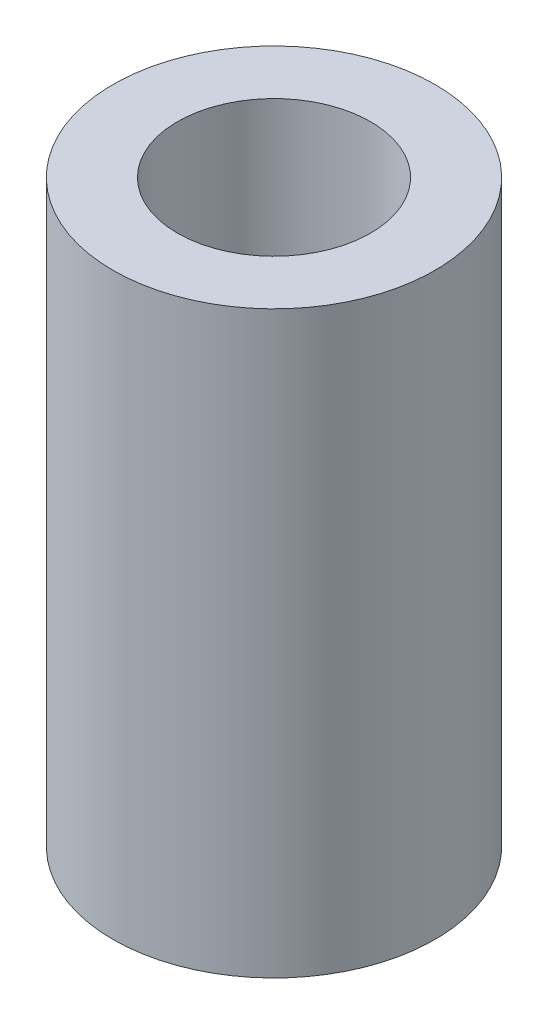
ISO-10303-21;
HEADER;
FILE_DESCRIPTION(('STEP AP214'),'2;1');
FILE_NAME('part.step','',(''),(''),'','','');
FILE_SCHEMA(('AUTOMOTIVE_DESIGN { 1 0 10303 214 1 1 1 1 }'));
ENDSEC;
DATA;
#1=APPLICATION_CONTEXT('core data for automotive mechanical design processes');
#2=APPLICATION_PROTOCOL_DEFINITION('international standard','automotive_design',2000,#1);
#3=PRODUCT_CONTEXT('',#1,'mechanical');
#4=PRODUCT('Part','Part','',(#3));
#5=PRODUCT_RELATED_PRODUCT_CATEGORY('part','',(#4));
#6=PRODUCT_DEFINITION_FORMATION('','',#4);
#7=PRODUCT_DEFINITION_CONTEXT('part definition',#1,'design');
#8=PRODUCT_DEFINITION('design','',#6,#7);
#9=PRODUCT_DEFINITION_SHAPE('','',#8);
#10=(LENGTH_UNIT() NAMED_UNIT(*) SI_UNIT(.MILLI.,.METRE.));
#11=(NAMED_UNIT(*) PLANE_ANGLE_UNIT() SI_UNIT($,.RADIAN.));
#12=(NAMED_UNIT(*) SI_UNIT($,.STERADIAN.) SOLID_ANGLE_UNIT());
#13=UNCERTAINTY_MEASURE_WITH_UNIT(LENGTH_MEASURE(1.E-05),#10,'distance_accuracy_value','');
#14=(GEOMETRIC_REPRESENTATION_CONTEXT(3) GLOBAL_UNCERTAINTY_ASSIGNED_CONTEXT((#13)) GLOBAL_UNIT_ASSIGNED_CONTEXT((#10,
#11,#12)) REPRESENTATION_CONTEXT('',''));
#15=CARTESIAN_POINT('',(0.,0.,0.));
#16=DIRECTION('',(0.,0.,1.));
#17=DIRECTION('',(1.,0.,0.));
#18=AXIS2_PLACEMENT_3D('',#15,#16,#17);
#19=CARTESIAN_POINT('',(0.,3.,0.));
#20=DIRECTION('',(0.,-1.,0.));
#21=DIRECTION('',(0.,0.,-1.));
#22=AXIS2_PLACEMENT_3D('',#19,#20,#21);
#23=CYLINDRICAL_SURFACE('',#22,5.);
#24=CARTESIAN_POINT('',(0.,0.,0.));
#25=DIRECTION('',(0.,1.,0.));
#26=DIRECTION('',(0.,0.,1.));
#27=AXIS2_PLACEMENT_3D('',#24,#25,#26);
#28=CIRCLE('',#27,5.);
#29=CARTESIAN_POINT('',(0.,0.,5.));
#30=VERTEX_POINT('',#29);
#31=EDGE_CURVE('E45',#30,#30,#28,.T.);
#32=ORIENTED_EDGE('',*,*,#31,.T.);
#33=EDGE_LOOP('',(#32));
#34=FACE_BOUND('',#33,.T.);
#35=CARTESIAN_POINT('',(0.,18.,0.));
#36=DIRECTION('',(0.,1.,0.));
#37=DIRECTION('',(0.,0.,1.));
#38=AXIS2_PLACEMENT_3D('',#35,#36,#37);
#39=CIRCLE('',#38,5.);
#40=CARTESIAN_POINT('',(0.,18.,5.));
#41=VERTEX_POINT('',#40);
#42=EDGE_CURVE('E50',#41,#41,#39,.T.);
#43=ORIENTED_EDGE('',*,*,#42,.F.);
#44=EDGE_LOOP('',(#43));
#45=FACE_BOUND('',#44,.T.);
#46=ADVANCED_FACE('F37',(#34,#45),#23,.T.);
#47=CARTESIAN_POINT('',(0.,0.,0.));
#48=DIRECTION('',(0.,1.,0.));
#49=DIRECTION('',(0.,0.,1.));
#50=AXIS2_PLACEMENT_3D('',#47,#48,#49);
#51=PLANE('',#50);
#52=CARTESIAN_POINT('',(0.,0.,0.));
#53=DIRECTION('',(0.,-1.,0.));
#54=DIRECTION('',(0.,0.,-1.));
#55=AXIS2_PLACEMENT_3D('',#52,#53,#54);
#56=CIRCLE('',#55,1.45);
#57=CARTESIAN_POINT('',(0.,0.,-1.45));
#58=VERTEX_POINT('',#57);
#59=EDGE_CURVE('E60',#58,#58,#56,.T.);
#60=ORIENTED_EDGE('',*,*,#59,.F.);
#61=EDGE_LOOP('',(#60));
#62=FACE_BOUND('',#61,.T.);
#63=ORIENTED_EDGE('',*,*,#31,.F.);
#64=EDGE_LOOP('',(#63));
#65=FACE_BOUND('',#64,.T.);
#66=ADVANCED_FACE('F86',(#62,#65),#51,.F.);
#67=CARTESIAN_POINT('',(0.,18.,0.));
#68=DIRECTION('',(0.,1.,0.));
#69=DIRECTION('',(0.,0.,1.));
#70=AXIS2_PLACEMENT_3D('',#67,#68,#69);
#71=PLANE('',#70);
#72=ORIENTED_EDGE('',*,*,#42,.T.);
#73=EDGE_LOOP('',(#72));
#74=FACE_BOUND('',#73,.T.);
#75=CARTESIAN_POINT('',(0.,18.,0.));
#76=DIRECTION('',(0.,1.,0.));
#77=DIRECTION('',(0.,0.,1.));
#78=AXIS2_PLACEMENT_3D('',#75,#76,#77);
#79=CIRCLE('',#78,3.);
#80=CARTESIAN_POINT('',(0.,18.,3.));
#81=VERTEX_POINT('',#80);
#82=EDGE_CURVE('E56',#81,#81,#79,.T.);
#83=ORIENTED_EDGE('',*,*,#82,.F.);
#84=EDGE_LOOP('',(#83));
#85=FACE_BOUND('',#84,.T.);
#86=ADVANCED_FACE('F81',(#74,#85),#71,.T.);
#87=CARTESIAN_POINT('',(0.,18.,0.));
#88=DIRECTION('',(0.,-1.,0.));
#89=DIRECTION('',(0.,0.,-1.));
#90=AXIS2_PLACEMENT_3D('',#87,#88,#89);
#91=CYLINDRICAL_SURFACE('',#90,3.);
#92=ORIENTED_EDGE('',*,*,#82,.T.);
#93=EDGE_LOOP('',(#92));
#94=FACE_BOUND('',#93,.T.);
#95=CARTESIAN_POINT('',(0.,3.,0.));
#96=DIRECTION('',(0.,1.,0.));
#97=DIRECTION('',(0.,0.,1.));
#98=AXIS2_PLACEMENT_3D('',#95,#96,#97);
#99=CIRCLE('',#98,3.);
#100=CARTESIAN_POINT('',(0.,3.,3.));
#101=VERTEX_POINT('',#100);
#102=EDGE_CURVE('E10',#101,#101,#99,.F.);
#103=ORIENTED_EDGE('',*,*,#102,.T.);
#104=EDGE_LOOP('',(#103));
#105=FACE_BOUND('',#104,.T.);
#106=ADVANCED_FACE('F74',(#94,#105),#91,.F.);
#107=CARTESIAN_POINT('',(0.,3.,0.));
#108=DIRECTION('',(0.,1.,0.));
#109=DIRECTION('',(0.,0.,1.));
#110=AXIS2_PLACEMENT_3D('',#107,#108,#109);
#111=PLANE('',#110);
#112=CARTESIAN_POINT('',(0.,3.,0.));
#113=DIRECTION('',(0.,1.,0.));
#114=DIRECTION('',(0.,0.,1.));
#115=AXIS2_PLACEMENT_3D('',#112,#113,#114);
#116=CIRCLE('',#115,1.45);
#117=CARTESIAN_POINT('',(0.,3.,1.45));
#118=VERTEX_POINT('',#117);
#119=EDGE_CURVE('E40',#118,#118,#116,.T.);
#120=ORIENTED_EDGE('',*,*,#119,.F.);
#121=EDGE_LOOP('',(#120));
#122=FACE_BOUND('',#121,.T.);
#123=ORIENTED_EDGE('',*,*,#102,.F.);
#124=EDGE_LOOP('',(#123));
#125=FACE_BOUND('',#124,.T.);
#126=ADVANCED_FACE('F71',(#122,#125),#111,.T.);
#127=CARTESIAN_POINT('',(0.,0.,0.));
#128=DIRECTION('',(0.,-1.,0.));
#129=DIRECTION('',(0.,0.,-1.));
#130=AXIS2_PLACEMENT_3D('',#127,#128,#129);
#131=CYLINDRICAL_SURFACE('',#130,1.45);
#132=ORIENTED_EDGE('',*,*,#119,.T.);
#133=EDGE_LOOP('',(#132));
#134=FACE_BOUND('',#133,.T.);
#135=ORIENTED_EDGE('',*,*,#59,.T.);
#136=EDGE_LOOP('',(#135));
#137=FACE_BOUND('',#136,.T.);
#138=ADVANCED_FACE('F69',(#134,#137),#131,.F.);
#139=CLOSED_SHELL('',(#46,#66,#86,#106,#126,#138));
#140=MANIFOLD_SOLID_BREP('B2',#139);
#141=ADVANCED_BREP_SHAPE_REPRESENTATION('',(#18,#140),#14);
#142=SHAPE_DEFINITION_REPRESENTATION(#9,#141);
ENDSEC;
END-ISO-10303-21;
